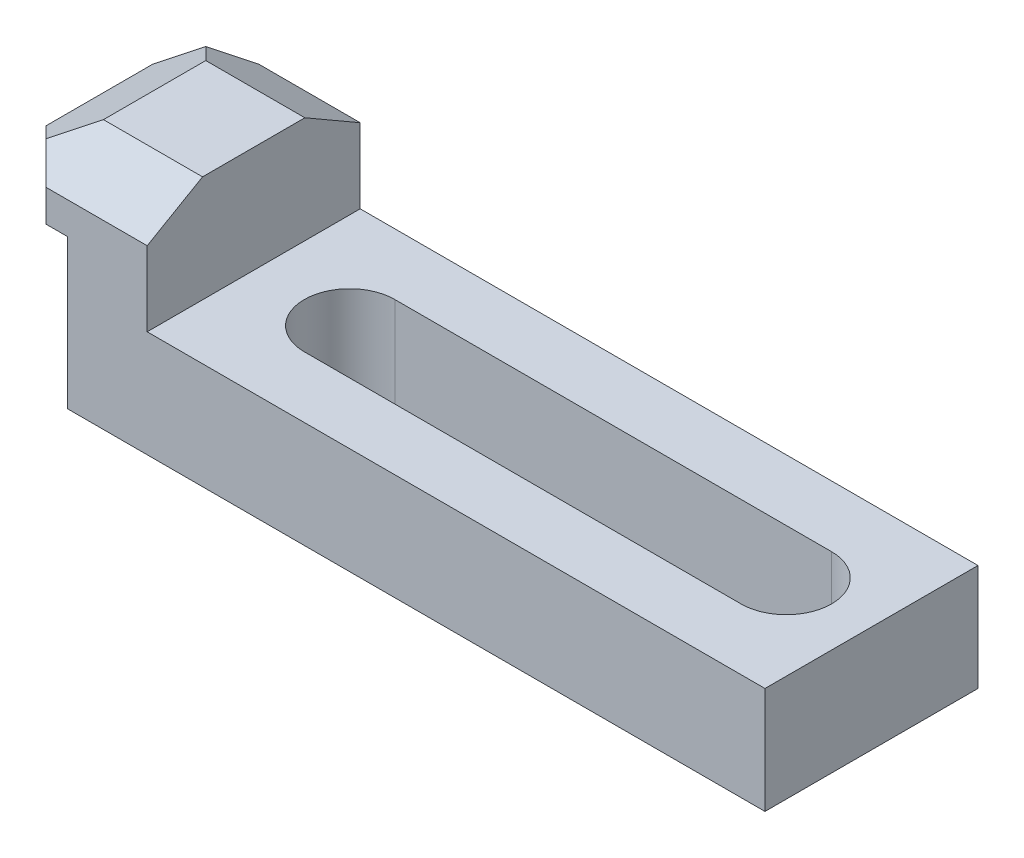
from build123d import *
from OCP.BRepFilletAPI import BRepFilletAPI_MakeChamfer

# Parameters (mm, degrees)
EXTRUDE1_DEPTH = 20
CHAMFER1_SIZE  = 6
CHAMFER1_SIZE2 = 10.392304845
EXTRUDE2_DEPTH = 152.739909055


with BuildPart() as part:
    # Sketch1 → Extrude1 (new, symmetric)
    with BuildSketch(Plane.XY):
        Polygon((0, 0), (14, 0), (14, -28), (145, -28), (145, -8), (29, -8), (29, 12), (0, 12), align=None)
    extrude(amount=EXTRUDE1_DEPTH, both=True)

    # Chamfer1: one chamfer whose edges measure the first distance from different faces: ONE call of the kernel's chamfer builder (chamfer() names one face for all edges)
    chamfer1_edges_1 = [part.edges().sort_by_distance(p)[0] for p in [
        (0, 12, 0),
    ]]
    chamfer1_side_1 = [part.faces().sort_by_distance(p)[0] for p in [
        (0, 6, 0),
    ]]
    chamfer1_edges_2 = [part.edges().sort_by_distance(p)[0] for p in [
        (14.5, 12, 20),
    ]]
    chamfer1_side_2 = [part.faces().sort_by_distance(p)[0] for p in [
        (69.920984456, -14.751295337, 20),
    ]]
    chamfer1_edges_3 = [part.edges().sort_by_distance(p)[0] for p in [
        (14.5, 12, -20),
    ]]
    chamfer1_side_3 = [part.faces().sort_by_distance(p)[0] for p in [
        (69.920984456, -14.751295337, -20),
    ]]
    chamfer1 = BRepFilletAPI_MakeChamfer(part.part.solid().wrapped)
    for e in chamfer1_edges_1:
        chamfer1.Add(CHAMFER1_SIZE, CHAMFER1_SIZE2, e.wrapped, chamfer1_side_1[0].wrapped)  # the first distance lies on this face
    for e in chamfer1_edges_2:
        chamfer1.Add(CHAMFER1_SIZE, CHAMFER1_SIZE2, e.wrapped, chamfer1_side_2[0].wrapped)  # the first distance lies on this face
    for e in chamfer1_edges_3:
        chamfer1.Add(CHAMFER1_SIZE, CHAMFER1_SIZE2, e.wrapped, chamfer1_side_3[0].wrapped)  # the first distance lies on this face
    add(Compound.cast(chamfer1.Shape()), mode=Mode.REPLACE)

    # Sketch2 → Extrude2 (cut, through all)
    with BuildSketch(Plane.XZ.offset(28)):
        with BuildLine():
            Line((47, 8.5), (129, 8.5))
            ThreePointArc((129, 8.5), (137.5, 0), (129, -8.5))
            Line((129, -8.5), (47, -8.5))
            ThreePointArc((47, -8.5), (38.5, 0), (47, 8.5))
        make_face()
        Polygon((0, 20), (10, 20), (0, 10), align=None)
        Polygon((0, -10), (0, -20), (10, -20), align=None)
    extrude(amount=-EXTRUDE2_DEPTH, mode=Mode.SUBTRACT)


solid = part.part
